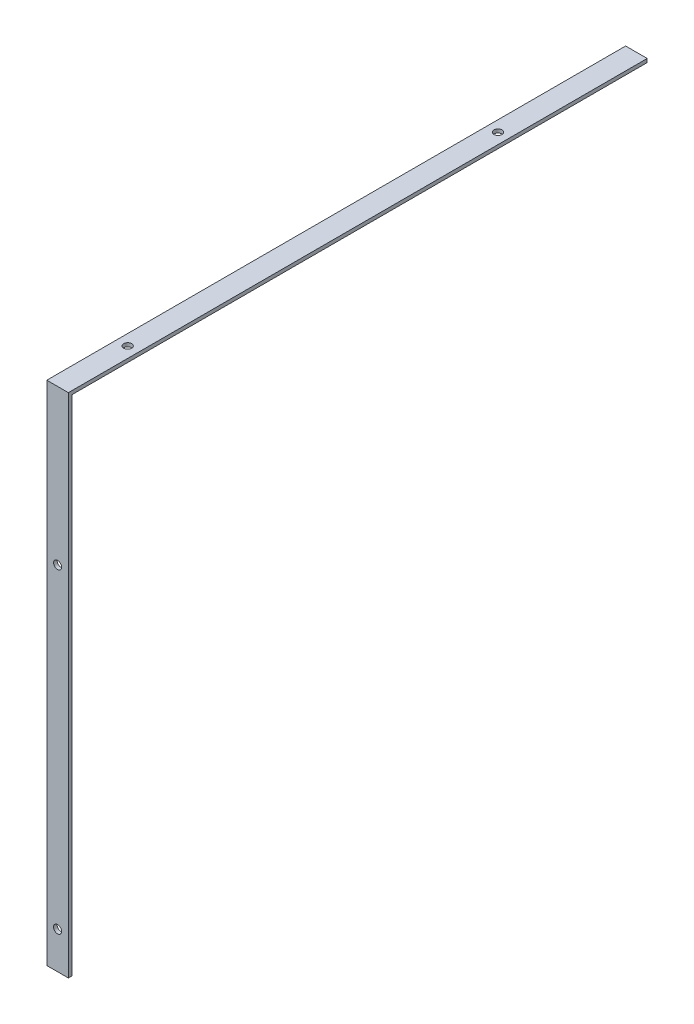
ISO-10303-21;
HEADER;
FILE_DESCRIPTION(('STEP AP214'),'2;1');
FILE_NAME('part.step','',(''),(''),'','','');
FILE_SCHEMA(('AUTOMOTIVE_DESIGN { 1 0 10303 214 1 1 1 1 }'));
ENDSEC;
DATA;
#1=APPLICATION_CONTEXT('core data for automotive mechanical design processes');
#2=APPLICATION_PROTOCOL_DEFINITION('international standard','automotive_design',2000,#1);
#3=PRODUCT_CONTEXT('',#1,'mechanical');
#4=PRODUCT('Part','Part','',(#3));
#5=PRODUCT_RELATED_PRODUCT_CATEGORY('part','',(#4));
#6=PRODUCT_DEFINITION_FORMATION('','',#4);
#7=PRODUCT_DEFINITION_CONTEXT('part definition',#1,'design');
#8=PRODUCT_DEFINITION('design','',#6,#7);
#9=PRODUCT_DEFINITION_SHAPE('','',#8);
#10=(LENGTH_UNIT() NAMED_UNIT(*) SI_UNIT(.MILLI.,.METRE.));
#11=(NAMED_UNIT(*) PLANE_ANGLE_UNIT() SI_UNIT($,.RADIAN.));
#12=(NAMED_UNIT(*) SI_UNIT($,.STERADIAN.) SOLID_ANGLE_UNIT());
#13=UNCERTAINTY_MEASURE_WITH_UNIT(LENGTH_MEASURE(1.E-05),#10,'distance_accuracy_value','');
#14=(GEOMETRIC_REPRESENTATION_CONTEXT(3) GLOBAL_UNCERTAINTY_ASSIGNED_CONTEXT((#13)) GLOBAL_UNIT_ASSIGNED_CONTEXT((#10,
#11,#12)) REPRESENTATION_CONTEXT('',''));
#15=CARTESIAN_POINT('',(0.,0.,0.));
#16=DIRECTION('',(0.,0.,1.));
#17=DIRECTION('',(1.,0.,0.));
#18=AXIS2_PLACEMENT_3D('',#15,#16,#17);
#19=CARTESIAN_POINT('',(15.24,0.,408.94));
#20=DIRECTION('',(0.,0.,-1.));
#21=DIRECTION('',(0.,1.,0.));
#22=AXIS2_PLACEMENT_3D('',#19,#20,#21);
#23=PLANE('',#22);
#24=CARTESIAN_POINT('',(7.62,-329.563501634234,408.94));
#25=DIRECTION('',(0.,0.,-1.));
#26=DIRECTION('',(0.,1.,0.));
#27=AXIS2_PLACEMENT_3D('',#24,#25,#26);
#28=CIRCLE('',#27,2.83209999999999);
#29=CARTESIAN_POINT('',(7.62,-326.731401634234,408.94));
#30=VERTEX_POINT('',#29);
#31=EDGE_CURVE('E183',#30,#30,#28,.T.);
#32=ORIENTED_EDGE('',*,*,#31,.T.);
#33=EDGE_LOOP('',(#32));
#34=FACE_BOUND('',#33,.T.);
#35=CARTESIAN_POINT('',(7.62,-106.68,408.94));
#36=DIRECTION('',(0.,0.,-1.));
#37=DIRECTION('',(0.,1.,0.));
#38=AXIS2_PLACEMENT_3D('',#35,#36,#37);
#39=CIRCLE('',#38,2.8321);
#40=CARTESIAN_POINT('',(7.62,-103.8479,408.94));
#41=VERTEX_POINT('',#40);
#42=EDGE_CURVE('E186',#41,#41,#39,.T.);
#43=ORIENTED_EDGE('',*,*,#42,.T.);
#44=EDGE_LOOP('',(#43));
#45=FACE_BOUND('',#44,.T.);
#46=DIRECTION('',(0.,-1.,0.));
#47=VECTOR('',#46,1.);
#48=CARTESIAN_POINT('',(0.,0.,408.94));
#49=LINE('',#48,#47);
#50=CARTESIAN_POINT('',(0.,2.53999999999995,408.94));
#51=VERTEX_POINT('',#50);
#52=CARTESIAN_POINT('',(0.,-355.6,408.94));
#53=VERTEX_POINT('',#52);
#54=EDGE_CURVE('E125',#51,#53,#49,.T.);
#55=ORIENTED_EDGE('',*,*,#54,.T.);
#56=DIRECTION('',(-1.,0.,0.));
#57=VECTOR('',#56,1.);
#58=CARTESIAN_POINT('',(15.24,-355.6,408.94));
#59=LINE('',#58,#57);
#60=CARTESIAN_POINT('',(15.24,-355.6,408.94));
#61=VERTEX_POINT('',#60);
#62=EDGE_CURVE('E11',#61,#53,#59,.T.);
#63=ORIENTED_EDGE('',*,*,#62,.F.);
#64=DIRECTION('',(0.,-1.,0.));
#65=VECTOR('',#64,1.);
#66=CARTESIAN_POINT('',(15.24,0.,408.94));
#67=LINE('',#66,#65);
#68=CARTESIAN_POINT('',(15.24,2.53999999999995,408.94));
#69=VERTEX_POINT('',#68);
#70=EDGE_CURVE('E86',#69,#61,#67,.T.);
#71=ORIENTED_EDGE('',*,*,#70,.F.);
#72=DIRECTION('',(-1.,0.,0.));
#73=VECTOR('',#72,1.);
#74=CARTESIAN_POINT('',(15.24,2.53999999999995,408.94));
#75=LINE('',#74,#73);
#76=EDGE_CURVE('E121',#69,#51,#75,.T.);
#77=ORIENTED_EDGE('',*,*,#76,.T.);
#78=EDGE_LOOP('',(#55,#63,#71,#77));
#79=FACE_BOUND('',#78,.T.);
#80=ADVANCED_FACE('F39',(#34,#45,#79),#23,.F.);
#81=CARTESIAN_POINT('',(15.24,-355.6,406.4));
#82=DIRECTION('',(0.,-1.,0.));
#83=DIRECTION('',(0.,0.,-1.));
#84=AXIS2_PLACEMENT_3D('',#81,#82,#83);
#85=PLANE('',#84);
#86=DIRECTION('',(0.,0.,1.));
#87=VECTOR('',#86,1.);
#88=CARTESIAN_POINT('',(0.,-355.6,406.4));
#89=LINE('',#88,#87);
#90=CARTESIAN_POINT('',(0.,-355.6,406.4));
#91=VERTEX_POINT('',#90);
#92=EDGE_CURVE('E129',#91,#53,#89,.T.);
#93=ORIENTED_EDGE('',*,*,#92,.F.);
#94=DIRECTION('',(-1.,0.,0.));
#95=VECTOR('',#94,1.);
#96=CARTESIAN_POINT('',(15.24,-355.6,406.4));
#97=LINE('',#96,#95);
#98=CARTESIAN_POINT('',(15.24,-355.6,406.4));
#99=VERTEX_POINT('',#98);
#100=EDGE_CURVE('E48',#99,#91,#97,.T.);
#101=ORIENTED_EDGE('',*,*,#100,.F.);
#102=DIRECTION('',(0.,0.,1.));
#103=VECTOR('',#102,1.);
#104=CARTESIAN_POINT('',(15.24,-355.6,406.4));
#105=LINE('',#104,#103);
#106=EDGE_CURVE('E216',#99,#61,#105,.T.);
#107=ORIENTED_EDGE('',*,*,#106,.T.);
#108=ORIENTED_EDGE('',*,*,#62,.T.);
#109=EDGE_LOOP('',(#93,#101,#107,#108));
#110=FACE_BOUND('',#109,.T.);
#111=ADVANCED_FACE('F157',(#110),#85,.T.);
#112=CARTESIAN_POINT('',(15.24,0.,406.4));
#113=DIRECTION('',(0.,0.,-1.));
#114=DIRECTION('',(0.,1.,0.));
#115=AXIS2_PLACEMENT_3D('',#112,#113,#114);
#116=PLANE('',#115);
#117=CARTESIAN_POINT('',(7.62,-329.563501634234,406.4));
#118=DIRECTION('',(0.,0.,-1.));
#119=DIRECTION('',(0.,1.,0.));
#120=AXIS2_PLACEMENT_3D('',#117,#118,#119);
#121=CIRCLE('',#120,2.83209999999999);
#122=CARTESIAN_POINT('',(7.62,-326.731401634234,406.4));
#123=VERTEX_POINT('',#122);
#124=EDGE_CURVE('E189',#123,#123,#121,.T.);
#125=ORIENTED_EDGE('',*,*,#124,.F.);
#126=EDGE_LOOP('',(#125));
#127=FACE_BOUND('',#126,.T.);
#128=CARTESIAN_POINT('',(7.62,-106.68,406.4));
#129=DIRECTION('',(0.,0.,-1.));
#130=DIRECTION('',(0.,1.,0.));
#131=AXIS2_PLACEMENT_3D('',#128,#129,#130);
#132=CIRCLE('',#131,2.8321);
#133=CARTESIAN_POINT('',(7.62,-103.8479,406.4));
#134=VERTEX_POINT('',#133);
#135=EDGE_CURVE('E190',#134,#134,#132,.T.);
#136=ORIENTED_EDGE('',*,*,#135,.F.);
#137=EDGE_LOOP('',(#136));
#138=FACE_BOUND('',#137,.T.);
#139=DIRECTION('',(0.,-1.,0.));
#140=VECTOR('',#139,1.);
#141=CARTESIAN_POINT('',(0.,0.,406.4));
#142=LINE('',#141,#140);
#143=CARTESIAN_POINT('',(0.,0.,406.4));
#144=VERTEX_POINT('',#143);
#145=EDGE_CURVE('E134',#144,#91,#142,.T.);
#146=ORIENTED_EDGE('',*,*,#145,.F.);
#147=DIRECTION('',(-1.,0.,0.));
#148=VECTOR('',#147,1.);
#149=CARTESIAN_POINT('',(15.24,0.,406.4));
#150=LINE('',#149,#148);
#151=CARTESIAN_POINT('',(15.24,0.,406.4));
#152=VERTEX_POINT('',#151);
#153=EDGE_CURVE('E108',#152,#144,#150,.T.);
#154=ORIENTED_EDGE('',*,*,#153,.F.);
#155=DIRECTION('',(0.,-1.,0.));
#156=VECTOR('',#155,1.);
#157=CARTESIAN_POINT('',(15.24,0.,406.4));
#158=LINE('',#157,#156);
#159=EDGE_CURVE('E114',#152,#99,#158,.T.);
#160=ORIENTED_EDGE('',*,*,#159,.T.);
#161=ORIENTED_EDGE('',*,*,#100,.T.);
#162=EDGE_LOOP('',(#146,#154,#160,#161));
#163=FACE_BOUND('',#162,.T.);
#164=ADVANCED_FACE('F154',(#127,#138,#163),#116,.T.);
#165=CARTESIAN_POINT('',(15.24,0.,0.));
#166=DIRECTION('',(0.,-1.,0.));
#167=DIRECTION('',(0.,0.,-1.));
#168=AXIS2_PLACEMENT_3D('',#165,#166,#167);
#169=PLANE('',#168);
#170=CARTESIAN_POINT('',(7.62,0.,97.79));
#171=DIRECTION('',(0.,-1.,0.));
#172=DIRECTION('',(0.,0.,-1.));
#173=AXIS2_PLACEMENT_3D('',#170,#171,#172);
#174=CIRCLE('',#173,2.8575);
#175=CARTESIAN_POINT('',(7.62,0.,94.9325));
#176=VERTEX_POINT('',#175);
#177=EDGE_CURVE('E202',#176,#176,#174,.T.);
#178=ORIENTED_EDGE('',*,*,#177,.F.);
#179=EDGE_LOOP('',(#178));
#180=FACE_BOUND('',#179,.T.);
#181=CARTESIAN_POINT('',(7.62,0.,359.41));
#182=DIRECTION('',(0.,-1.,0.));
#183=DIRECTION('',(0.,0.,-1.));
#184=AXIS2_PLACEMENT_3D('',#181,#182,#183);
#185=CIRCLE('',#184,2.83209999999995);
#186=CARTESIAN_POINT('',(7.62,0.,356.5779));
#187=VERTEX_POINT('',#186);
#188=EDGE_CURVE('E210',#187,#187,#185,.T.);
#189=ORIENTED_EDGE('',*,*,#188,.F.);
#190=EDGE_LOOP('',(#189));
#191=FACE_BOUND('',#190,.T.);
#192=DIRECTION('',(0.,0.,1.));
#193=VECTOR('',#192,1.);
#194=CARTESIAN_POINT('',(0.,0.,0.));
#195=LINE('',#194,#193);
#196=CARTESIAN_POINT('',(0.,0.,0.));
#197=VERTEX_POINT('',#196);
#198=EDGE_CURVE('E102',#197,#144,#195,.T.);
#199=ORIENTED_EDGE('',*,*,#198,.F.);
#200=DIRECTION('',(-1.,0.,0.));
#201=VECTOR('',#200,1.);
#202=CARTESIAN_POINT('',(15.24,0.,0.));
#203=LINE('',#202,#201);
#204=CARTESIAN_POINT('',(15.24,0.,0.));
#205=VERTEX_POINT('',#204);
#206=EDGE_CURVE('E97',#205,#197,#203,.T.);
#207=ORIENTED_EDGE('',*,*,#206,.F.);
#208=DIRECTION('',(0.,0.,1.));
#209=VECTOR('',#208,1.);
#210=CARTESIAN_POINT('',(15.24,0.,0.));
#211=LINE('',#210,#209);
#212=EDGE_CURVE('E100',#205,#152,#211,.T.);
#213=ORIENTED_EDGE('',*,*,#212,.T.);
#214=ORIENTED_EDGE('',*,*,#153,.T.);
#215=EDGE_LOOP('',(#199,#207,#213,#214));
#216=FACE_BOUND('',#215,.T.);
#217=ADVANCED_FACE('F99',(#180,#191,#216),#169,.T.);
#218=CARTESIAN_POINT('',(15.24,2.54,0.));
#219=DIRECTION('',(0.,0.,-1.));
#220=DIRECTION('',(0.,1.,0.));
#221=AXIS2_PLACEMENT_3D('',#218,#219,#220);
#222=PLANE('',#221);
#223=DIRECTION('',(0.,-1.,0.));
#224=VECTOR('',#223,1.);
#225=CARTESIAN_POINT('',(0.,2.54,0.));
#226=LINE('',#225,#224);
#227=CARTESIAN_POINT('',(0.,2.54,0.));
#228=VERTEX_POINT('',#227);
#229=EDGE_CURVE('E140',#228,#197,#226,.T.);
#230=ORIENTED_EDGE('',*,*,#229,.F.);
#231=DIRECTION('',(-1.,0.,0.));
#232=VECTOR('',#231,1.);
#233=CARTESIAN_POINT('',(15.24,2.54,0.));
#234=LINE('',#233,#232);
#235=CARTESIAN_POINT('',(15.24,2.54,0.));
#236=VERTEX_POINT('',#235);
#237=EDGE_CURVE('E77',#236,#228,#234,.T.);
#238=ORIENTED_EDGE('',*,*,#237,.F.);
#239=DIRECTION('',(0.,-1.,0.));
#240=VECTOR('',#239,1.);
#241=CARTESIAN_POINT('',(15.24,2.54,0.));
#242=LINE('',#241,#240);
#243=EDGE_CURVE('E112',#236,#205,#242,.T.);
#244=ORIENTED_EDGE('',*,*,#243,.T.);
#245=ORIENTED_EDGE('',*,*,#206,.T.);
#246=EDGE_LOOP('',(#230,#238,#244,#245));
#247=FACE_BOUND('',#246,.T.);
#248=ADVANCED_FACE('F117',(#247),#222,.T.);
#249=CARTESIAN_POINT('',(15.24,2.54,0.));
#250=DIRECTION('',(0.,-1.,0.));
#251=DIRECTION('',(0.,0.,-1.));
#252=AXIS2_PLACEMENT_3D('',#249,#250,#251);
#253=PLANE('',#252);
#254=CARTESIAN_POINT('',(7.62,2.53999999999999,97.79));
#255=DIRECTION('',(0.,-1.,0.));
#256=DIRECTION('',(0.,0.,-1.));
#257=AXIS2_PLACEMENT_3D('',#254,#255,#256);
#258=CIRCLE('',#257,2.8575);
#259=CARTESIAN_POINT('',(7.62,2.53999999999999,94.9325));
#260=VERTEX_POINT('',#259);
#261=EDGE_CURVE('E130',#260,#260,#258,.T.);
#262=ORIENTED_EDGE('',*,*,#261,.T.);
#263=EDGE_LOOP('',(#262));
#264=FACE_BOUND('',#263,.T.);
#265=CARTESIAN_POINT('',(7.62,2.53999999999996,359.41));
#266=DIRECTION('',(0.,-1.,0.));
#267=DIRECTION('',(0.,0.,-1.));
#268=AXIS2_PLACEMENT_3D('',#265,#266,#267);
#269=CIRCLE('',#268,2.83209999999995);
#270=CARTESIAN_POINT('',(7.62,2.53999999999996,356.5779));
#271=VERTEX_POINT('',#270);
#272=EDGE_CURVE('E206',#271,#271,#269,.T.);
#273=ORIENTED_EDGE('',*,*,#272,.T.);
#274=EDGE_LOOP('',(#273));
#275=FACE_BOUND('',#274,.T.);
#276=DIRECTION('',(0.,0.,1.));
#277=VECTOR('',#276,1.);
#278=CARTESIAN_POINT('',(0.,2.54,0.));
#279=LINE('',#278,#277);
#280=EDGE_CURVE('E80',#228,#51,#279,.T.);
#281=ORIENTED_EDGE('',*,*,#280,.T.);
#282=ORIENTED_EDGE('',*,*,#76,.F.);
#283=DIRECTION('',(0.,0.,1.));
#284=VECTOR('',#283,1.);
#285=CARTESIAN_POINT('',(15.24,2.54,0.));
#286=LINE('',#285,#284);
#287=EDGE_CURVE('E56',#236,#69,#286,.T.);
#288=ORIENTED_EDGE('',*,*,#287,.F.);
#289=ORIENTED_EDGE('',*,*,#237,.T.);
#290=EDGE_LOOP('',(#281,#282,#288,#289));
#291=FACE_BOUND('',#290,.T.);
#292=ADVANCED_FACE('F162',(#264,#275,#291),#253,.F.);
#293=CARTESIAN_POINT('',(15.24,0.,0.));
#294=DIRECTION('',(-1.,0.,0.));
#295=DIRECTION('',(0.,0.,1.));
#296=AXIS2_PLACEMENT_3D('',#293,#294,#295);
#297=PLANE('',#296);
#298=ORIENTED_EDGE('',*,*,#70,.T.);
#299=ORIENTED_EDGE('',*,*,#106,.F.);
#300=ORIENTED_EDGE('',*,*,#159,.F.);
#301=ORIENTED_EDGE('',*,*,#212,.F.);
#302=ORIENTED_EDGE('',*,*,#243,.F.);
#303=ORIENTED_EDGE('',*,*,#287,.T.);
#304=EDGE_LOOP('',(#298,#299,#300,#301,#302,#303));
#305=FACE_BOUND('',#304,.T.);
#306=ADVANCED_FACE('F111',(#305),#297,.F.);
#307=CARTESIAN_POINT('',(0.,0.,0.));
#308=DIRECTION('',(-1.,0.,0.));
#309=DIRECTION('',(0.,0.,1.));
#310=AXIS2_PLACEMENT_3D('',#307,#308,#309);
#311=PLANE('',#310);
#312=ORIENTED_EDGE('',*,*,#54,.F.);
#313=ORIENTED_EDGE('',*,*,#280,.F.);
#314=ORIENTED_EDGE('',*,*,#229,.T.);
#315=ORIENTED_EDGE('',*,*,#198,.T.);
#316=ORIENTED_EDGE('',*,*,#145,.T.);
#317=ORIENTED_EDGE('',*,*,#92,.T.);
#318=EDGE_LOOP('',(#312,#313,#314,#315,#316,#317));
#319=FACE_BOUND('',#318,.T.);
#320=ADVANCED_FACE('F160',(#319),#311,.T.);
#321=CARTESIAN_POINT('',(7.62,2.53999999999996,359.41));
#322=DIRECTION('',(0.,-1.,0.));
#323=DIRECTION('',(0.,0.,-1.));
#324=AXIS2_PLACEMENT_3D('',#321,#322,#323);
#325=CYLINDRICAL_SURFACE('',#324,2.83209999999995);
#326=ORIENTED_EDGE('',*,*,#272,.F.);
#327=EDGE_LOOP('',(#326));
#328=FACE_BOUND('',#327,.T.);
#329=ORIENTED_EDGE('',*,*,#188,.T.);
#330=EDGE_LOOP('',(#329));
#331=FACE_BOUND('',#330,.T.);
#332=ADVANCED_FACE('F222',(#328,#331),#325,.F.);
#333=CARTESIAN_POINT('',(7.62,2.53999999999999,97.79));
#334=DIRECTION('',(0.,-1.,0.));
#335=DIRECTION('',(0.,0.,-1.));
#336=AXIS2_PLACEMENT_3D('',#333,#334,#335);
#337=CYLINDRICAL_SURFACE('',#336,2.8575);
#338=ORIENTED_EDGE('',*,*,#261,.F.);
#339=EDGE_LOOP('',(#338));
#340=FACE_BOUND('',#339,.T.);
#341=ORIENTED_EDGE('',*,*,#177,.T.);
#342=EDGE_LOOP('',(#341));
#343=FACE_BOUND('',#342,.T.);
#344=ADVANCED_FACE('F234',(#340,#343),#337,.F.);
#345=CARTESIAN_POINT('',(7.62,-106.68,408.94));
#346=DIRECTION('',(0.,0.,-1.));
#347=DIRECTION('',(0.,1.,0.));
#348=AXIS2_PLACEMENT_3D('',#345,#346,#347);
#349=CYLINDRICAL_SURFACE('',#348,2.8321);
#350=ORIENTED_EDGE('',*,*,#42,.F.);
#351=EDGE_LOOP('',(#350));
#352=FACE_BOUND('',#351,.T.);
#353=ORIENTED_EDGE('',*,*,#135,.T.);
#354=EDGE_LOOP('',(#353));
#355=FACE_BOUND('',#354,.T.);
#356=ADVANCED_FACE('F236',(#352,#355),#349,.F.);
#357=CARTESIAN_POINT('',(7.62,-329.563501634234,408.94));
#358=DIRECTION('',(0.,0.,-1.));
#359=DIRECTION('',(0.,1.,0.));
#360=AXIS2_PLACEMENT_3D('',#357,#358,#359);
#361=CYLINDRICAL_SURFACE('',#360,2.83209999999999);
#362=ORIENTED_EDGE('',*,*,#31,.F.);
#363=EDGE_LOOP('',(#362));
#364=FACE_BOUND('',#363,.T.);
#365=ORIENTED_EDGE('',*,*,#124,.T.);
#366=EDGE_LOOP('',(#365));
#367=FACE_BOUND('',#366,.T.);
#368=ADVANCED_FACE('F243',(#364,#367),#361,.F.);
#369=CLOSED_SHELL('',(#80,#111,#164,#217,#248,#292,#306,#320,#332,#344,#356,#368));
#370=MANIFOLD_SOLID_BREP('B2',#369);
#371=ADVANCED_BREP_SHAPE_REPRESENTATION('',(#18,#370),#14);
#372=SHAPE_DEFINITION_REPRESENTATION(#9,#371);
ENDSEC;
END-ISO-10303-21;
